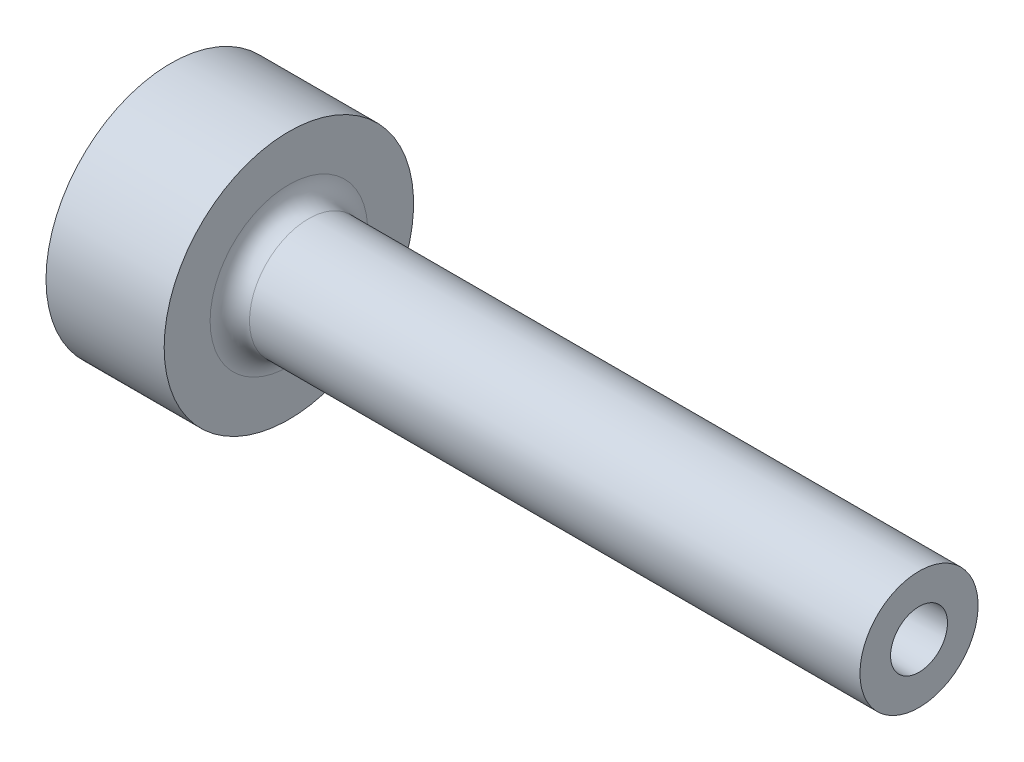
ISO-10303-21;
HEADER;
FILE_DESCRIPTION(('STEP AP214'),'2;1');
FILE_NAME('part.step','',(''),(''),'','','');
FILE_SCHEMA(('AUTOMOTIVE_DESIGN { 1 0 10303 214 1 1 1 1 }'));
ENDSEC;
DATA;
#1=APPLICATION_CONTEXT('core data for automotive mechanical design processes');
#2=APPLICATION_PROTOCOL_DEFINITION('international standard','automotive_design',2000,#1);
#3=PRODUCT_CONTEXT('',#1,'mechanical');
#4=PRODUCT('Part','Part','',(#3));
#5=PRODUCT_RELATED_PRODUCT_CATEGORY('part','',(#4));
#6=PRODUCT_DEFINITION_FORMATION('','',#4);
#7=PRODUCT_DEFINITION_CONTEXT('part definition',#1,'design');
#8=PRODUCT_DEFINITION('design','',#6,#7);
#9=PRODUCT_DEFINITION_SHAPE('','',#8);
#10=(LENGTH_UNIT() NAMED_UNIT(*) SI_UNIT(.MILLI.,.METRE.));
#11=(NAMED_UNIT(*) PLANE_ANGLE_UNIT() SI_UNIT($,.RADIAN.));
#12=(NAMED_UNIT(*) SI_UNIT($,.STERADIAN.) SOLID_ANGLE_UNIT());
#13=UNCERTAINTY_MEASURE_WITH_UNIT(LENGTH_MEASURE(1.E-05),#10,'distance_accuracy_value','');
#14=(GEOMETRIC_REPRESENTATION_CONTEXT(3) GLOBAL_UNCERTAINTY_ASSIGNED_CONTEXT((#13)) GLOBAL_UNIT_ASSIGNED_CONTEXT((#10,
#11,#12)) REPRESENTATION_CONTEXT('',''));
#15=CARTESIAN_POINT('',(0.,0.,0.));
#16=DIRECTION('',(0.,0.,1.));
#17=DIRECTION('',(1.,0.,0.));
#18=AXIS2_PLACEMENT_3D('',#15,#16,#17);
#19=CARTESIAN_POINT('',(0.,0.,0.));
#20=DIRECTION('',(-1.,0.,0.));
#21=DIRECTION('',(0.,0.,1.));
#22=AXIS2_PLACEMENT_3D('',#19,#20,#21);
#23=CYLINDRICAL_SURFACE('',#22,19.);
#24=CARTESIAN_POINT('',(18.,0.,0.));
#25=DIRECTION('',(-1.,0.,0.));
#26=DIRECTION('',(0.,0.,1.));
#27=AXIS2_PLACEMENT_3D('',#24,#25,#26);
#28=CIRCLE('',#27,19.);
#29=CARTESIAN_POINT('',(18.,0.,19.));
#30=VERTEX_POINT('',#29);
#31=EDGE_CURVE('E91',#30,#30,#28,.T.);
#32=ORIENTED_EDGE('',*,*,#31,.T.);
#33=EDGE_LOOP('',(#32));
#34=FACE_BOUND('',#33,.T.);
#35=CARTESIAN_POINT('',(0.,0.,0.));
#36=DIRECTION('',(-1.,0.,0.));
#37=DIRECTION('',(0.,0.,1.));
#38=AXIS2_PLACEMENT_3D('',#35,#36,#37);
#39=CIRCLE('',#38,19.);
#40=CARTESIAN_POINT('',(0.,0.,19.));
#41=VERTEX_POINT('',#40);
#42=EDGE_CURVE('E85',#41,#41,#39,.T.);
#43=ORIENTED_EDGE('',*,*,#42,.F.);
#44=EDGE_LOOP('',(#43));
#45=FACE_BOUND('',#44,.T.);
#46=CARTESIAN_POINT('',(11.,-19.,0.));
#47=CARTESIAN_POINT('',(10.9999951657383,-18.9999986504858,0.11200841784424));
#48=CARTESIAN_POINT('',(10.9905588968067,-18.9989990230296,0.224090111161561));
#49=CARTESIAN_POINT('',(10.953059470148,-18.9951074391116,0.445143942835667));
#50=CARTESIAN_POINT('',(10.9249759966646,-18.9922134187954,0.554112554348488));
#51=CARTESIAN_POINT('',(10.8510107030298,-18.9848596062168,0.765707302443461));
#52=CARTESIAN_POINT('',(10.8051398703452,-18.9804007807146,0.868337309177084));
#53=CARTESIAN_POINT('',(10.696923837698,-18.9704154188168,1.06441973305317));
#54=CARTESIAN_POINT('',(10.6345818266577,-18.9648890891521,1.15787392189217));
#55=CARTESIAN_POINT('',(10.494927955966,-18.9533628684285,1.33334438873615));
#56=CARTESIAN_POINT('',(10.417564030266,-18.9473613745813,1.41531912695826));
#57=CARTESIAN_POINT('',(10.2501736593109,-18.9355744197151,1.565146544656));
#58=CARTESIAN_POINT('',(10.1601466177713,-18.9297889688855,1.63299855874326));
#59=CARTESIAN_POINT('',(9.96972339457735,-18.9190729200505,1.75280323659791));
#60=CARTESIAN_POINT('',(9.86930325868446,-18.914144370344,1.80471802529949));
#61=CARTESIAN_POINT('',(9.66111022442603,-18.9057203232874,1.89093273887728));
#62=CARTESIAN_POINT('',(9.55333752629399,-18.90222478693,1.92523314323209));
#63=CARTESIAN_POINT('',(9.333924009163,-18.8970772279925,1.97512160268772));
#64=CARTESIAN_POINT('',(9.22229908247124,-18.89541839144,1.99077883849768));
#65=CARTESIAN_POINT('',(8.99799439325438,-18.8941109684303,2.0031504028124));
#66=CARTESIAN_POINT('',(8.88531466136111,-18.8944623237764,1.99986527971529));
#67=CARTESIAN_POINT('',(8.66257681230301,-18.8971293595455,1.97450235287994));
#68=CARTESIAN_POINT('',(8.55250997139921,-18.8994371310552,1.9525002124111));
#69=CARTESIAN_POINT('',(8.33763983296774,-18.9057446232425,1.89044560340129));
#70=CARTESIAN_POINT('',(8.23283661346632,-18.9097443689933,1.85039286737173));
#71=CARTESIAN_POINT('',(8.0312304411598,-18.9189942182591,1.75329092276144));
#72=CARTESIAN_POINT('',(7.93444370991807,-18.924246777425,1.69620827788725));
#73=CARTESIAN_POINT('',(7.75179548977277,-18.9354083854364,1.5666908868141));
#74=CARTESIAN_POINT('',(7.66593435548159,-18.9413174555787,1.49425564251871));
#75=CARTESIAN_POINT('',(7.50713503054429,-18.9531615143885,1.33566725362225));
#76=CARTESIAN_POINT('',(7.43426205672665,-18.9590964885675,1.24944878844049));
#77=CARTESIAN_POINT('',(7.30401357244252,-18.9702964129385,1.06596783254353));
#78=CARTESIAN_POINT('',(7.24663808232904,-18.9755613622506,0.968705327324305));
#79=CARTESIAN_POINT('',(7.14901535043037,-18.9848300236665,0.765851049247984));
#80=CARTESIAN_POINT('',(7.10877156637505,-18.9888334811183,0.660257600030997));
#81=CARTESIAN_POINT('',(7.04660317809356,-18.9951255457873,0.443760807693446));
#82=CARTESIAN_POINT('',(7.02467796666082,-18.9974142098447,0.332857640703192));
#83=CARTESIAN_POINT('',(6.9998521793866,-19.0000115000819,0.109454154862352));
#84=CARTESIAN_POINT('',(6.9968616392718,-19.0003294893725,-0.00303606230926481));
#85=CARTESIAN_POINT('',(7.00975357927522,-18.9989747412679,-0.226916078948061));
#86=CARTESIAN_POINT('',(7.02563577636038,-18.9973020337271,-0.338305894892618));
#87=CARTESIAN_POINT('',(7.07574769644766,-18.9921598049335,-0.556562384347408));
#88=CARTESIAN_POINT('',(7.10993514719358,-18.9886944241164,-0.663438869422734));
#89=CARTESIAN_POINT('',(7.1956435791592,-18.9803554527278,-0.869940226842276));
#90=CARTESIAN_POINT('',(7.24716498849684,-18.9754818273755,-0.969564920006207));
#91=CARTESIAN_POINT('',(7.36630089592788,-18.9648478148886,-1.1591405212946));
#92=CARTESIAN_POINT('',(7.43397432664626,-18.9590842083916,-1.2490542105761));
#93=CARTESIAN_POINT('',(7.58340899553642,-18.9473268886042,-1.4162783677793));
#94=CARTESIAN_POINT('',(7.665170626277,-18.9413331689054,-1.49358848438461));
#95=CARTESIAN_POINT('',(7.84085406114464,-18.9297628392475,-1.63372463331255));
#96=CARTESIAN_POINT('',(7.93482318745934,-18.9241879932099,-1.69649150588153));
#97=CARTESIAN_POINT('',(8.13202150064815,-18.9141138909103,-1.80535237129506));
#98=CARTESIAN_POINT('',(8.23525054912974,-18.9096146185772,-1.85144661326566));
#99=CARTESIAN_POINT('',(8.44783784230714,-18.9022123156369,-1.9255553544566));
#100=CARTESIAN_POINT('',(8.55718382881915,-18.8993062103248,-1.95360469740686));
#101=CARTESIAN_POINT('',(8.77906579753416,-18.8954098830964,-1.99094032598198));
#102=CARTESIAN_POINT('',(8.89160167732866,-18.8944195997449,-2.00022721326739));
#103=CARTESIAN_POINT('',(9.11608086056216,-18.8944684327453,-1.99976544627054));
#104=CARTESIAN_POINT('',(9.22802436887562,-18.8954976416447,-1.99010972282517));
#105=CARTESIAN_POINT('',(9.4486892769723,-18.8994483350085,-1.95223204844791));
#106=CARTESIAN_POINT('',(9.55741067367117,-18.9023698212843,-1.92401007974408));
#107=CARTESIAN_POINT('',(9.76854219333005,-18.9097730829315,-1.8498273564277));
#108=CARTESIAN_POINT('',(9.87095340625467,-18.914254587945,-1.80386967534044));
#109=CARTESIAN_POINT('',(10.0666237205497,-18.92427346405,-1.69552954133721));
#110=CARTESIAN_POINT('',(10.1598828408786,-18.9298108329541,-1.63314712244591));
#111=CARTESIAN_POINT('',(10.3350778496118,-18.9413500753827,-1.49337993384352));
#112=CARTESIAN_POINT('',(10.4169583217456,-18.9473540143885,-1.41592586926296));
#113=CARTESIAN_POINT('',(10.5665993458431,-18.9591311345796,-1.24835332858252));
#114=CARTESIAN_POINT('',(10.6343565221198,-18.9649042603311,-1.15823183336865));
#115=CARTESIAN_POINT('',(10.7539774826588,-18.975586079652,-0.967607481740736));
#116=CARTESIAN_POINT('',(10.8057969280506,-18.9804923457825,-0.867076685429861));
#117=CARTESIAN_POINT('',(10.8917493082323,-18.9888617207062,-0.658751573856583));
#118=CARTESIAN_POINT('',(10.9259020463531,-18.9923264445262,-0.550965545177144));
#119=CARTESIAN_POINT('',(10.9671005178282,-18.9965585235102,-0.368815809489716));
#120=CARTESIAN_POINT('',(10.9794208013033,-18.9978430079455,-0.295613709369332));
#121=CARTESIAN_POINT('',(10.9958721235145,-18.9995641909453,-0.148285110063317));
#122=CARTESIAN_POINT('',(11.0000032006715,-19.0000008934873,-0.0741586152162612));
#123=CARTESIAN_POINT('',(11.,-19.,0.));
#124=B_SPLINE_CURVE_WITH_KNOTS('',3,(#46,#47,#48,#49,#50,#51,#52,#53,#54,#55,#56,#57,#58,#59,
#60,#61,#62,#63,#64,#65,#66,#67,#68,#69,#70,#71,#72,#73,#74,#75,#76,#77,#78,#79,#80,#81,#82,#83,
#84,#85,#86,#87,#88,#89,#90,#91,#92,#93,#94,#95,#96,#97,#98,#99,#100,#101,#102,#103,#104,#105,
#106,#107,#108,#109,#110,#111,#112,#113,#114,#115,#116,#117,#118,#119,#120,#121,#122,#123),
.UNSPECIFIED.,.T.,.F.,(4,2,2,2,2,2,2,2,2,2,2,2,2,2,2,2,2,2,2,2,2,2,2,2,2,2,2,2,2,2,2,2,2,2,2,2,
2,2,4),(0.,0.335754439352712,0.671875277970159,1.00778882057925,1.34363737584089,
1.68067146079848,2.01772142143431,2.35556629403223,2.69340196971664,3.02998006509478,
3.36654841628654,3.7017626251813,4.03698180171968,4.37286352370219,4.70875614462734,
5.0462905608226,5.38382542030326,5.72142837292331,6.05902013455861,6.39500668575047,
6.73098819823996,7.06619715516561,7.40141439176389,7.73787392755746,8.07434284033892,
8.41215732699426,8.74996676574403,9.08712193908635,9.42426630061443,9.75976079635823,
10.095255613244,10.4306923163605,10.7661283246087,11.103144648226,11.4402414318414,
11.7782677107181,12.1159142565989,12.3382118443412,12.5605083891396),.UNSPECIFIED.);
#125=CARTESIAN_POINT('',(11.,-19.,0.));
#126=VERTEX_POINT('',#125);
#127=EDGE_CURVE('E10',#126,#126,#124,.T.);
#128=ORIENTED_EDGE('',*,*,#127,.F.);
#129=EDGE_LOOP('',(#128));
#130=FACE_BOUND('',#129,.T.);
#131=ADVANCED_FACE('F16',(#34,#45,#130),#23,.T.);
#132=CARTESIAN_POINT('',(0.,0.,0.));
#133=DIRECTION('',(1.,0.,0.));
#134=DIRECTION('',(0.,0.,-1.));
#135=AXIS2_PLACEMENT_3D('',#132,#133,#134);
#136=CONICAL_SURFACE('',#135,1.75,0.0226892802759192);
#137=CARTESIAN_POINT('',(114.,0.,0.));
#138=DIRECTION('',(-1.,0.,0.));
#139=DIRECTION('',(0.,0.,1.));
#140=AXIS2_PLACEMENT_3D('',#137,#138,#139);
#141=CIRCLE('',#140,4.33702190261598);
#142=CARTESIAN_POINT('',(114.,0.,4.33702190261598));
#143=VERTEX_POINT('',#142);
#144=EDGE_CURVE('E77',#143,#143,#141,.T.);
#145=ORIENTED_EDGE('',*,*,#144,.F.);
#146=EDGE_LOOP('',(#145));
#147=FACE_BOUND('',#146,.T.);
#148=CARTESIAN_POINT('',(3.86351757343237,0.,0.));
#149=DIRECTION('',(-1.,0.,0.));
#150=DIRECTION('',(0.,0.,1.));
#151=AXIS2_PLACEMENT_3D('',#148,#149,#150);
#152=CIRCLE('',#151,1.83767547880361);
#153=CARTESIAN_POINT('',(3.86351757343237,0.,1.83767547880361));
#154=VERTEX_POINT('',#153);
#155=EDGE_CURVE('E96',#154,#154,#152,.F.);
#156=ORIENTED_EDGE('',*,*,#155,.F.);
#157=EDGE_LOOP('',(#156));
#158=FACE_BOUND('',#157,.T.);
#159=ADVANCED_FACE('F44',(#147,#158),#136,.F.);
#160=CARTESIAN_POINT('',(21.,0.,0.));
#161=DIRECTION('',(-1.,0.,0.));
#162=DIRECTION('',(0.,0.,1.));
#163=AXIS2_PLACEMENT_3D('',#160,#161,#162);
#164=TOROIDAL_SURFACE('',#163,12.,3.);
#165=CARTESIAN_POINT('',(18.,0.,0.));
#166=DIRECTION('',(-1.,0.,0.));
#167=DIRECTION('',(0.,0.,1.));
#168=AXIS2_PLACEMENT_3D('',#165,#166,#167);
#169=CIRCLE('',#168,12.);
#170=CARTESIAN_POINT('',(18.,0.,12.));
#171=VERTEX_POINT('',#170);
#172=EDGE_CURVE('E93',#171,#171,#169,.T.);
#173=ORIENTED_EDGE('',*,*,#172,.F.);
#174=EDGE_LOOP('',(#173));
#175=FACE_BOUND('',#174,.T.);
#176=CARTESIAN_POINT('',(21.,0.,0.));
#177=DIRECTION('',(-1.,0.,0.));
#178=DIRECTION('',(0.,0.,1.));
#179=AXIS2_PLACEMENT_3D('',#176,#177,#178);
#180=CIRCLE('',#179,9.);
#181=CARTESIAN_POINT('',(21.,0.,9.));
#182=VERTEX_POINT('',#181);
#183=EDGE_CURVE('E29',#182,#182,#180,.T.);
#184=ORIENTED_EDGE('',*,*,#183,.T.);
#185=EDGE_LOOP('',(#184));
#186=FACE_BOUND('',#185,.T.);
#187=ADVANCED_FACE('F18',(#175,#186),#164,.F.);
#188=CARTESIAN_POINT('',(0.,0.,0.));
#189=DIRECTION('',(-1.,0.,0.));
#190=DIRECTION('',(0.,0.,1.));
#191=AXIS2_PLACEMENT_3D('',#188,#189,#190);
#192=CYLINDRICAL_SURFACE('',#191,9.);
#193=ORIENTED_EDGE('',*,*,#183,.F.);
#194=EDGE_LOOP('',(#193));
#195=FACE_BOUND('',#194,.T.);
#196=CARTESIAN_POINT('',(114.,0.,0.));
#197=DIRECTION('',(-1.,0.,0.));
#198=DIRECTION('',(0.,0.,1.));
#199=AXIS2_PLACEMENT_3D('',#196,#197,#198);
#200=CIRCLE('',#199,9.);
#201=CARTESIAN_POINT('',(114.,0.,9.));
#202=VERTEX_POINT('',#201);
#203=EDGE_CURVE('E75',#202,#202,#200,.T.);
#204=ORIENTED_EDGE('',*,*,#203,.T.);
#205=EDGE_LOOP('',(#204));
#206=FACE_BOUND('',#205,.T.);
#207=ADVANCED_FACE('F63',(#195,#206),#192,.T.);
#208=CARTESIAN_POINT('',(114.,9.,0.));
#209=DIRECTION('',(-1.,0.,0.));
#210=DIRECTION('',(0.,0.,1.));
#211=AXIS2_PLACEMENT_3D('',#208,#209,#210);
#212=PLANE('',#211);
#213=ORIENTED_EDGE('',*,*,#203,.F.);
#214=EDGE_LOOP('',(#213));
#215=FACE_BOUND('',#214,.T.);
#216=ORIENTED_EDGE('',*,*,#144,.T.);
#217=EDGE_LOOP('',(#216));
#218=FACE_BOUND('',#217,.T.);
#219=ADVANCED_FACE('F59',(#215,#218),#212,.F.);
#220=CARTESIAN_POINT('',(0.,1.75,0.));
#221=DIRECTION('',(1.,0.,0.));
#222=DIRECTION('',(0.,0.,-1.));
#223=AXIS2_PLACEMENT_3D('',#220,#221,#222);
#224=PLANE('',#223);
#225=CARTESIAN_POINT('',(0.,0.,0.));
#226=DIRECTION('',(-1.,0.,0.));
#227=DIRECTION('',(0.,0.,1.));
#228=AXIS2_PLACEMENT_3D('',#225,#226,#227);
#229=CIRCLE('',#228,15.5);
#230=CARTESIAN_POINT('',(0.,0.,15.5));
#231=VERTEX_POINT('',#230);
#232=EDGE_CURVE('E100',#231,#231,#229,.T.);
#233=ORIENTED_EDGE('',*,*,#232,.F.);
#234=EDGE_LOOP('',(#233));
#235=FACE_BOUND('',#234,.T.);
#236=ORIENTED_EDGE('',*,*,#42,.T.);
#237=EDGE_LOOP('',(#236));
#238=FACE_BOUND('',#237,.T.);
#239=ADVANCED_FACE('F57',(#235,#238),#224,.F.);
#240=CARTESIAN_POINT('',(18.,19.,0.));
#241=DIRECTION('',(-1.,0.,0.));
#242=DIRECTION('',(0.,0.,1.));
#243=AXIS2_PLACEMENT_3D('',#240,#241,#242);
#244=PLANE('',#243);
#245=ORIENTED_EDGE('',*,*,#31,.F.);
#246=EDGE_LOOP('',(#245));
#247=FACE_BOUND('',#246,.T.);
#248=ORIENTED_EDGE('',*,*,#172,.T.);
#249=EDGE_LOOP('',(#248));
#250=FACE_BOUND('',#249,.T.);
#251=ADVANCED_FACE('F55',(#247,#250),#244,.F.);
#252=CARTESIAN_POINT('',(-35.9477938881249,0.,0.));
#253=DIRECTION('',(-1.,0.,0.));
#254=DIRECTION('',(0.,0.,1.));
#255=AXIS2_PLACEMENT_3D('',#252,#253,#254);
#256=DEGENERATE_TOROIDAL_SURFACE('',#255,2.0429790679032,40.,.F.);
#257=ORIENTED_EDGE('',*,*,#232,.T.);
#258=EDGE_LOOP('',(#257));
#259=FACE_BOUND('',#258,.T.);
#260=ORIENTED_EDGE('',*,*,#155,.T.);
#261=EDGE_LOOP('',(#260));
#262=FACE_BOUND('',#261,.T.);
#263=ADVANCED_FACE('F40',(#259,#262),#256,.T.);
#264=CARTESIAN_POINT('',(9.,-19.,0.));
#265=DIRECTION('',(0.,-1.,0.));
#266=DIRECTION('',(1.,0.,0.));
#267=AXIS2_PLACEMENT_3D('',#264,#265,#266);
#268=CYLINDRICAL_SURFACE('',#267,2.);
#269=CARTESIAN_POINT('',(9.,-13.,0.));
#270=DIRECTION('',(0.,-1.,0.));
#271=DIRECTION('',(1.,0.,0.));
#272=AXIS2_PLACEMENT_3D('',#269,#270,#271);
#273=CIRCLE('',#272,2.);
#274=CARTESIAN_POINT('',(11.,-13.,0.));
#275=VERTEX_POINT('',#274);
#276=EDGE_CURVE('E104',#275,#275,#273,.T.);
#277=ORIENTED_EDGE('',*,*,#276,.F.);
#278=EDGE_LOOP('',(#277));
#279=FACE_BOUND('',#278,.T.);
#280=ORIENTED_EDGE('',*,*,#127,.T.);
#281=EDGE_LOOP('',(#280));
#282=FACE_BOUND('',#281,.T.);
#283=ADVANCED_FACE('F34',(#279,#282),#268,.F.);
#284=CARTESIAN_POINT('',(9.,-11.8452994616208,0.));
#285=DIRECTION('',(0.,-1.,0.));
#286=DIRECTION('',(1.,0.,0.));
#287=AXIS2_PLACEMENT_3D('',#284,#285,#286);
#288=CONICAL_SURFACE('',#287,0.,1.0471975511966);
#289=ORIENTED_EDGE('',*,*,#276,.T.);
#290=EDGE_LOOP('',(#289));
#291=FACE_BOUND('',#290,.T.);
#292=CARTESIAN_POINT('',(9.,-11.8452994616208,0.));
#293=VERTEX_POINT('',#292);
#294=VERTEX_LOOP('',#293);
#295=FACE_BOUND('',#294,.T.);
#296=ADVANCED_FACE('F32',(#291,#295),#288,.F.);
#297=CLOSED_SHELL('',(#131,#159,#187,#207,#219,#239,#251,#263,#283,#296));
#298=MANIFOLD_SOLID_BREP('B1',#297);
#299=ADVANCED_BREP_SHAPE_REPRESENTATION('',(#18,#298),#14);
#300=SHAPE_DEFINITION_REPRESENTATION(#9,#299);
ENDSEC;
END-ISO-10303-21;
